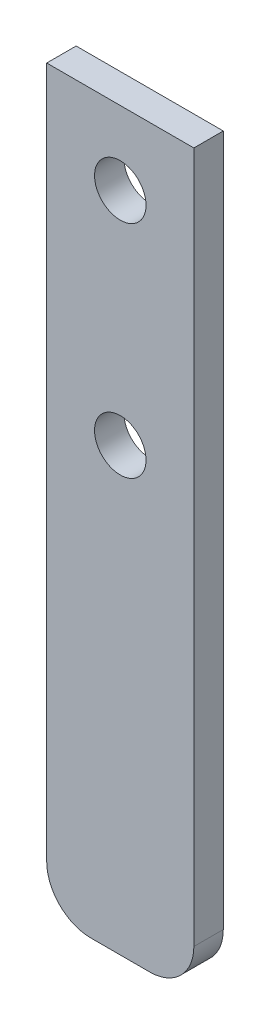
ISO-10303-21;
HEADER;
FILE_DESCRIPTION(('STEP AP214'),'2;1');
FILE_NAME('part.step','',(''),(''),'','','');
FILE_SCHEMA(('AUTOMOTIVE_DESIGN { 1 0 10303 214 1 1 1 1 }'));
ENDSEC;
DATA;
#1=APPLICATION_CONTEXT('core data for automotive mechanical design processes');
#2=APPLICATION_PROTOCOL_DEFINITION('international standard','automotive_design',2000,#1);
#3=PRODUCT_CONTEXT('',#1,'mechanical');
#4=PRODUCT('Part','Part','',(#3));
#5=PRODUCT_RELATED_PRODUCT_CATEGORY('part','',(#4));
#6=PRODUCT_DEFINITION_FORMATION('','',#4);
#7=PRODUCT_DEFINITION_CONTEXT('part definition',#1,'design');
#8=PRODUCT_DEFINITION('design','',#6,#7);
#9=PRODUCT_DEFINITION_SHAPE('','',#8);
#10=(LENGTH_UNIT() NAMED_UNIT(*) SI_UNIT(.MILLI.,.METRE.));
#11=(NAMED_UNIT(*) PLANE_ANGLE_UNIT() SI_UNIT($,.RADIAN.));
#12=(NAMED_UNIT(*) SI_UNIT($,.STERADIAN.) SOLID_ANGLE_UNIT());
#13=UNCERTAINTY_MEASURE_WITH_UNIT(LENGTH_MEASURE(1.E-05),#10,'distance_accuracy_value','');
#14=(GEOMETRIC_REPRESENTATION_CONTEXT(3) GLOBAL_UNCERTAINTY_ASSIGNED_CONTEXT((#13)) GLOBAL_UNIT_ASSIGNED_CONTEXT((#10,
#11,#12)) REPRESENTATION_CONTEXT('',''));
#15=CARTESIAN_POINT('',(0.,0.,0.));
#16=DIRECTION('',(0.,0.,1.));
#17=DIRECTION('',(1.,0.,0.));
#18=AXIS2_PLACEMENT_3D('',#15,#16,#17);
#19=CARTESIAN_POINT('',(0.,-55.0000000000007,2.));
#20=DIRECTION('',(-1.,0.,0.));
#21=DIRECTION('',(0.,-1.,0.));
#22=AXIS2_PLACEMENT_3D('',#19,#20,#21);
#23=PLANE('',#22);
#24=DIRECTION('',(0.,1.,0.));
#25=VECTOR('',#24,1.);
#26=CARTESIAN_POINT('',(0.,-55.0000000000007,2.));
#27=LINE('',#26,#25);
#28=CARTESIAN_POINT('',(0.,-102.,2.));
#29=VERTEX_POINT('',#28);
#30=CARTESIAN_POINT('',(0.,-55.0000000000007,2.));
#31=VERTEX_POINT('',#30);
#32=EDGE_CURVE('E69',#29,#31,#27,.T.);
#33=ORIENTED_EDGE('',*,*,#32,.F.);
#34=DIRECTION('',(0.,0.,-1.));
#35=VECTOR('',#34,1.);
#36=CARTESIAN_POINT('',(0.,-102.,2.));
#37=LINE('',#36,#35);
#38=CARTESIAN_POINT('',(0.,-102.,0.));
#39=VERTEX_POINT('',#38);
#40=EDGE_CURVE('E11',#29,#39,#37,.T.);
#41=ORIENTED_EDGE('',*,*,#40,.T.);
#42=DIRECTION('',(0.,1.,0.));
#43=VECTOR('',#42,1.);
#44=CARTESIAN_POINT('',(0.,-55.0000000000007,0.));
#45=LINE('',#44,#43);
#46=CARTESIAN_POINT('',(0.,-55.0000000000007,0.));
#47=VERTEX_POINT('',#46);
#48=EDGE_CURVE('E88',#39,#47,#45,.T.);
#49=ORIENTED_EDGE('',*,*,#48,.T.);
#50=DIRECTION('',(0.,0.,-1.));
#51=VECTOR('',#50,1.);
#52=CARTESIAN_POINT('',(0.,-55.0000000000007,2.));
#53=LINE('',#52,#51);
#54=EDGE_CURVE('E82',#31,#47,#53,.T.);
#55=ORIENTED_EDGE('',*,*,#54,.F.);
#56=EDGE_LOOP('',(#33,#41,#49,#55));
#57=FACE_BOUND('',#56,.T.);
#58=ADVANCED_FACE('F16',(#57),#23,.F.);
#59=CARTESIAN_POINT('',(0.,-55.0000000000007,2.));
#60=DIRECTION('',(0.,-1.,0.));
#61=DIRECTION('',(0.,0.,-1.));
#62=AXIS2_PLACEMENT_3D('',#59,#60,#61);
#63=PLANE('',#62);
#64=DIRECTION('',(-1.,0.,0.));
#65=VECTOR('',#64,1.);
#66=CARTESIAN_POINT('',(0.,-55.0000000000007,0.));
#67=LINE('',#66,#65);
#68=CARTESIAN_POINT('',(-10.,-55.0000000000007,0.));
#69=VERTEX_POINT('',#68);
#70=EDGE_CURVE('E121',#47,#69,#67,.T.);
#71=ORIENTED_EDGE('',*,*,#70,.T.);
#72=DIRECTION('',(0.,0.,-1.));
#73=VECTOR('',#72,1.);
#74=CARTESIAN_POINT('',(-10.,-55.0000000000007,2.));
#75=LINE('',#74,#73);
#76=CARTESIAN_POINT('',(-10.,-55.0000000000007,2.));
#77=VERTEX_POINT('',#76);
#78=EDGE_CURVE('E84',#77,#69,#75,.T.);
#79=ORIENTED_EDGE('',*,*,#78,.F.);
#80=DIRECTION('',(-1.,0.,0.));
#81=VECTOR('',#80,1.);
#82=CARTESIAN_POINT('',(0.,-55.0000000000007,2.));
#83=LINE('',#82,#81);
#84=EDGE_CURVE('E72',#31,#77,#83,.T.);
#85=ORIENTED_EDGE('',*,*,#84,.F.);
#86=ORIENTED_EDGE('',*,*,#54,.T.);
#87=EDGE_LOOP('',(#71,#79,#85,#86));
#88=FACE_BOUND('',#87,.T.);
#89=ADVANCED_FACE('F81',(#88),#63,.F.);
#90=CARTESIAN_POINT('',(-10.,-55.0000000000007,2.));
#91=DIRECTION('',(1.,0.,0.));
#92=DIRECTION('',(0.,1.,0.));
#93=AXIS2_PLACEMENT_3D('',#90,#91,#92);
#94=PLANE('',#93);
#95=DIRECTION('',(0.,-1.,0.));
#96=VECTOR('',#95,1.);
#97=CARTESIAN_POINT('',(-10.,-55.0000000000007,0.));
#98=LINE('',#97,#96);
#99=CARTESIAN_POINT('',(-10.,-102.,0.));
#100=VERTEX_POINT('',#99);
#101=EDGE_CURVE('E119',#69,#100,#98,.T.);
#102=ORIENTED_EDGE('',*,*,#101,.T.);
#103=DIRECTION('',(0.,0.,-1.));
#104=VECTOR('',#103,1.);
#105=CARTESIAN_POINT('',(-10.,-102.,2.));
#106=LINE('',#105,#104);
#107=CARTESIAN_POINT('',(-10.,-102.,2.));
#108=VERTEX_POINT('',#107);
#109=EDGE_CURVE('E39',#100,#108,#106,.F.);
#110=ORIENTED_EDGE('',*,*,#109,.T.);
#111=DIRECTION('',(0.,-1.,0.));
#112=VECTOR('',#111,1.);
#113=CARTESIAN_POINT('',(-10.,-55.0000000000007,2.));
#114=LINE('',#113,#112);
#115=EDGE_CURVE('E85',#77,#108,#114,.T.);
#116=ORIENTED_EDGE('',*,*,#115,.F.);
#117=ORIENTED_EDGE('',*,*,#78,.T.);
#118=EDGE_LOOP('',(#102,#110,#116,#117));
#119=FACE_BOUND('',#118,.T.);
#120=ADVANCED_FACE('F120',(#119),#94,.F.);
#121=CARTESIAN_POINT('',(0.,-105.,2.));
#122=DIRECTION('',(0.,1.,0.));
#123=DIRECTION('',(0.,0.,1.));
#124=AXIS2_PLACEMENT_3D('',#121,#122,#123);
#125=PLANE('',#124);
#126=DIRECTION('',(1.,0.,0.));
#127=VECTOR('',#126,1.);
#128=CARTESIAN_POINT('',(0.,-105.,2.));
#129=LINE('',#128,#127);
#130=CARTESIAN_POINT('',(-7.0000000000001,-105.,2.));
#131=VERTEX_POINT('',#130);
#132=CARTESIAN_POINT('',(-3.0000000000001,-105.,2.));
#133=VERTEX_POINT('',#132);
#134=EDGE_CURVE('E94',#131,#133,#129,.T.);
#135=ORIENTED_EDGE('',*,*,#134,.F.);
#136=DIRECTION('',(0.,0.,-1.));
#137=VECTOR('',#136,1.);
#138=CARTESIAN_POINT('',(-7.0000000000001,-105.,2.));
#139=LINE('',#138,#137);
#140=CARTESIAN_POINT('',(-7.0000000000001,-105.,0.));
#141=VERTEX_POINT('',#140);
#142=EDGE_CURVE('E92',#131,#141,#139,.T.);
#143=ORIENTED_EDGE('',*,*,#142,.T.);
#144=DIRECTION('',(1.,0.,0.));
#145=VECTOR('',#144,1.);
#146=CARTESIAN_POINT('',(0.,-105.,0.));
#147=LINE('',#146,#145);
#148=CARTESIAN_POINT('',(-3.0000000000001,-105.,0.));
#149=VERTEX_POINT('',#148);
#150=EDGE_CURVE('E77',#141,#149,#147,.T.);
#151=ORIENTED_EDGE('',*,*,#150,.T.);
#152=DIRECTION('',(0.,0.,-1.));
#153=VECTOR('',#152,1.);
#154=CARTESIAN_POINT('',(-3.0000000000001,-105.,2.));
#155=LINE('',#154,#153);
#156=EDGE_CURVE('E90',#149,#133,#155,.F.);
#157=ORIENTED_EDGE('',*,*,#156,.T.);
#158=EDGE_LOOP('',(#135,#143,#151,#157));
#159=FACE_BOUND('',#158,.T.);
#160=ADVANCED_FACE('F110',(#159),#125,.F.);
#161=CARTESIAN_POINT('',(0.,0.,2.));
#162=DIRECTION('',(0.,0.,-1.));
#163=DIRECTION('',(-1.,0.,0.));
#164=AXIS2_PLACEMENT_3D('',#161,#162,#163);
#165=PLANE('',#164);
#166=CARTESIAN_POINT('',(-5.0000000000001,-60.,2.));
#167=DIRECTION('',(0.,0.,1.));
#168=DIRECTION('',(1.,0.,0.));
#169=AXIS2_PLACEMENT_3D('',#166,#167,#168);
#170=CIRCLE('',#169,1.75);
#171=CARTESIAN_POINT('',(-3.2500000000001,-60.,2.));
#172=VERTEX_POINT('',#171);
#173=EDGE_CURVE('E136',#172,#172,#170,.T.);
#174=ORIENTED_EDGE('',*,*,#173,.F.);
#175=EDGE_LOOP('',(#174));
#176=FACE_BOUND('',#175,.T.);
#177=CARTESIAN_POINT('',(-5.0000000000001,-75.,2.));
#178=DIRECTION('',(0.,0.,1.));
#179=DIRECTION('',(1.,0.,0.));
#180=AXIS2_PLACEMENT_3D('',#177,#178,#179);
#181=CIRCLE('',#180,1.75);
#182=CARTESIAN_POINT('',(-3.2500000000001,-75.,2.));
#183=VERTEX_POINT('',#182);
#184=EDGE_CURVE('E130',#183,#183,#181,.T.);
#185=ORIENTED_EDGE('',*,*,#184,.F.);
#186=EDGE_LOOP('',(#185));
#187=FACE_BOUND('',#186,.T.);
#188=ORIENTED_EDGE('',*,*,#115,.T.);
#189=CARTESIAN_POINT('',(-7.0000000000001,-102.,2.));
#190=DIRECTION('',(0.,0.,-1.));
#191=DIRECTION('',(-1.,0.,0.));
#192=AXIS2_PLACEMENT_3D('',#189,#190,#191);
#193=CIRCLE('',#192,3.);
#194=EDGE_CURVE('E24',#108,#131,#193,.F.);
#195=ORIENTED_EDGE('',*,*,#194,.T.);
#196=ORIENTED_EDGE('',*,*,#134,.T.);
#197=CARTESIAN_POINT('',(-3.0000000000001,-102.,2.));
#198=DIRECTION('',(0.,0.,-1.));
#199=DIRECTION('',(-1.,0.,0.));
#200=AXIS2_PLACEMENT_3D('',#197,#198,#199);
#201=CIRCLE('',#200,3.);
#202=EDGE_CURVE('E31',#133,#29,#201,.F.);
#203=ORIENTED_EDGE('',*,*,#202,.T.);
#204=ORIENTED_EDGE('',*,*,#32,.T.);
#205=ORIENTED_EDGE('',*,*,#84,.T.);
#206=EDGE_LOOP('',(#188,#195,#196,#203,#204,#205));
#207=FACE_BOUND('',#206,.T.);
#208=ADVANCED_FACE('F71',(#176,#187,#207),#165,.F.);
#209=CARTESIAN_POINT('',(0.,0.,0.));
#210=DIRECTION('',(0.,0.,-1.));
#211=DIRECTION('',(-1.,0.,0.));
#212=AXIS2_PLACEMENT_3D('',#209,#210,#211);
#213=PLANE('',#212);
#214=CARTESIAN_POINT('',(-5.0000000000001,-60.,0.));
#215=DIRECTION('',(0.,0.,1.));
#216=DIRECTION('',(1.,0.,0.));
#217=AXIS2_PLACEMENT_3D('',#214,#215,#216);
#218=CIRCLE('',#217,1.75);
#219=CARTESIAN_POINT('',(-3.2500000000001,-60.,0.));
#220=VERTEX_POINT('',#219);
#221=EDGE_CURVE('E133',#220,#220,#218,.T.);
#222=ORIENTED_EDGE('',*,*,#221,.T.);
#223=EDGE_LOOP('',(#222));
#224=FACE_BOUND('',#223,.T.);
#225=CARTESIAN_POINT('',(-5.0000000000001,-75.,0.));
#226=DIRECTION('',(0.,0.,1.));
#227=DIRECTION('',(1.,0.,0.));
#228=AXIS2_PLACEMENT_3D('',#225,#226,#227);
#229=CIRCLE('',#228,1.75);
#230=CARTESIAN_POINT('',(-3.2500000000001,-75.,0.));
#231=VERTEX_POINT('',#230);
#232=EDGE_CURVE('E125',#231,#231,#229,.T.);
#233=ORIENTED_EDGE('',*,*,#232,.T.);
#234=EDGE_LOOP('',(#233));
#235=FACE_BOUND('',#234,.T.);
#236=ORIENTED_EDGE('',*,*,#150,.F.);
#237=CARTESIAN_POINT('',(-7.0000000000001,-102.,0.));
#238=DIRECTION('',(0.,0.,-1.));
#239=DIRECTION('',(-1.,0.,0.));
#240=AXIS2_PLACEMENT_3D('',#237,#238,#239);
#241=CIRCLE('',#240,3.);
#242=EDGE_CURVE('E102',#141,#100,#241,.T.);
#243=ORIENTED_EDGE('',*,*,#242,.T.);
#244=ORIENTED_EDGE('',*,*,#101,.F.);
#245=ORIENTED_EDGE('',*,*,#70,.F.);
#246=ORIENTED_EDGE('',*,*,#48,.F.);
#247=CARTESIAN_POINT('',(-3.0000000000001,-102.,0.));
#248=DIRECTION('',(0.,0.,-1.));
#249=DIRECTION('',(-1.,0.,0.));
#250=AXIS2_PLACEMENT_3D('',#247,#248,#249);
#251=CIRCLE('',#250,3.);
#252=EDGE_CURVE('E100',#39,#149,#251,.T.);
#253=ORIENTED_EDGE('',*,*,#252,.T.);
#254=EDGE_LOOP('',(#236,#243,#244,#245,#246,#253));
#255=FACE_BOUND('',#254,.T.);
#256=ADVANCED_FACE('F118',(#224,#235,#255),#213,.T.);
#257=CARTESIAN_POINT('',(-5.0000000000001,-75.,2.));
#258=DIRECTION('',(0.,0.,1.));
#259=DIRECTION('',(1.,0.,0.));
#260=AXIS2_PLACEMENT_3D('',#257,#258,#259);
#261=CYLINDRICAL_SURFACE('',#260,1.75);
#262=ORIENTED_EDGE('',*,*,#232,.F.);
#263=EDGE_LOOP('',(#262));
#264=FACE_BOUND('',#263,.T.);
#265=ORIENTED_EDGE('',*,*,#184,.T.);
#266=EDGE_LOOP('',(#265));
#267=FACE_BOUND('',#266,.T.);
#268=ADVANCED_FACE('F147',(#264,#267),#261,.F.);
#269=CARTESIAN_POINT('',(-5.0000000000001,-60.,2.));
#270=DIRECTION('',(0.,0.,1.));
#271=DIRECTION('',(1.,0.,0.));
#272=AXIS2_PLACEMENT_3D('',#269,#270,#271);
#273=CYLINDRICAL_SURFACE('',#272,1.75);
#274=ORIENTED_EDGE('',*,*,#221,.F.);
#275=EDGE_LOOP('',(#274));
#276=FACE_BOUND('',#275,.T.);
#277=ORIENTED_EDGE('',*,*,#173,.T.);
#278=EDGE_LOOP('',(#277));
#279=FACE_BOUND('',#278,.T.);
#280=ADVANCED_FACE('F140',(#276,#279),#273,.F.);
#281=CARTESIAN_POINT('',(-7.0000000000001,-102.,2.));
#282=DIRECTION('',(0.,0.,-1.));
#283=DIRECTION('',(-1.,0.,0.));
#284=AXIS2_PLACEMENT_3D('',#281,#282,#283);
#285=CYLINDRICAL_SURFACE('',#284,3.);
#286=ORIENTED_EDGE('',*,*,#194,.F.);
#287=ORIENTED_EDGE('',*,*,#109,.F.);
#288=ORIENTED_EDGE('',*,*,#242,.F.);
#289=ORIENTED_EDGE('',*,*,#142,.F.);
#290=EDGE_LOOP('',(#286,#287,#288,#289));
#291=FACE_BOUND('',#290,.T.);
#292=ADVANCED_FACE('F115',(#291),#285,.T.);
#293=CARTESIAN_POINT('',(-3.0000000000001,-102.,2.));
#294=DIRECTION('',(0.,0.,-1.));
#295=DIRECTION('',(-1.,0.,0.));
#296=AXIS2_PLACEMENT_3D('',#293,#294,#295);
#297=CYLINDRICAL_SURFACE('',#296,3.);
#298=ORIENTED_EDGE('',*,*,#202,.F.);
#299=ORIENTED_EDGE('',*,*,#156,.F.);
#300=ORIENTED_EDGE('',*,*,#252,.F.);
#301=ORIENTED_EDGE('',*,*,#40,.F.);
#302=EDGE_LOOP('',(#298,#299,#300,#301));
#303=FACE_BOUND('',#302,.T.);
#304=ADVANCED_FACE('F18',(#303),#297,.T.);
#305=CLOSED_SHELL('',(#58,#89,#120,#160,#208,#256,#268,#280,#292,#304));
#306=MANIFOLD_SOLID_BREP('B1',#305);
#307=ADVANCED_BREP_SHAPE_REPRESENTATION('',(#18,#306),#14);
#308=SHAPE_DEFINITION_REPRESENTATION(#9,#307);
ENDSEC;
END-ISO-10303-21;
